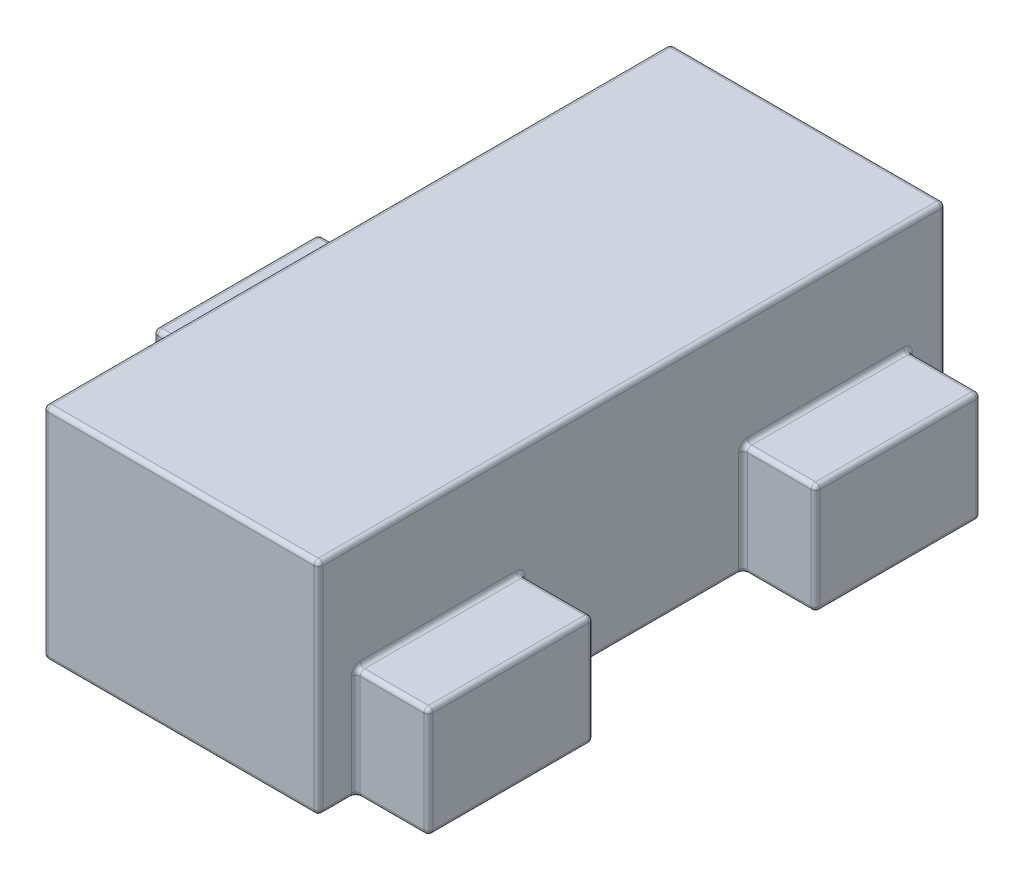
from build123d import *

# Parameters (mm, degrees)
SKETCH1_W           = 1.25
SKETCH1_H           = 2.85
BOSS_EXTRUDE1_DEPTH = 1
SKETCH2_W           = 0.55
SKETCH2_H           = 0.75
SKETCH2_W_2         = 0.33
BOSS_EXTRUDE2_DEPTH = 0.5
FILLET1_R           = 0.02


with BuildPart() as part:
    # Sketch1 → Boss-Extrude1 (new body)
    with BuildSketch(Plane(origin=(0, 0, 0), x_dir=(1, 0, 0), z_dir=(0, 1, 0))):
        Rectangle(SKETCH1_W, SKETCH1_H)
    extrude(amount=BOSS_EXTRUDE1_DEPTH)

    # Sketch2 → Boss-Extrude2 (add)
    with BuildSketch(Plane(origin=(0, 0, 0), x_dir=(1, 0, 0), z_dir=(0, 1, 0))):
        with Locations((-0.9, 0)):
            Rectangle(SKETCH2_W, SKETCH2_H)
        with Locations((0.79, 0.88)):
            Rectangle(SKETCH2_W_2, SKETCH2_H)
        with Locations((0.79, -0.88)):
            Rectangle(SKETCH2_W_2, SKETCH2_H)
    extrude(amount=BOSS_EXTRUDE2_DEPTH)

    # Fillet1
    fillet1_edges = [part.edges().sort_by_distance(p)[0] for p in [
        (-0.625, 1, 0),
        (0, 1, 1.425),
        (0.625, 0, -1.34),
        (0.625, 0.25, -1.255),
        (0.79, 0, -0.505),
        (0.625, 0.25, -0.505),
        (0.955, 0, -0.88),
        (0.955, 0.25, -0.505),
        (0.79, 0, -1.255),
        (0.955, 0.25, -1.255),
        (0.625, 0.5, -0.88),
        (0.79, 0.5, -0.505),
        (0.955, 0.5, -0.88),
        (0.79, 0.5, -1.255),
        (-0.625, 0, 0.9),
        (-0.9, 0, -0.375),
        (-0.625, 0.25, -0.375),
        (-1.175, 0, 0),
        (-1.175, 0.25, -0.375),
        (-0.9, 0, 0.375),
        (-1.175, 0.25, 0.375),
        (-0.625, 0.25, 0.375),
        (-0.9, 0.5, -0.375),
        (-1.175, 0.5, 0),
        (-0.9, 0.5, 0.375),
        (-0.625, 0.5, 0),
        (0.625, 0, 0),
        (0.625, 0.25, 0.505),
        (0.79, 0, 1.255),
        (0.625, 0.25, 1.255),
        (0.955, 0, 0.88),
        (0.955, 0.25, 1.255),
        (0.79, 0, 0.505),
        (0.955, 0.25, 0.505),
        (0.625, 0.5, 0.88),
        (0.79, 0.5, 1.255),
        (0.955, 0.5, 0.88),
        (0.625, 1, 0),
        (0.79, 0.5, 0.505),
        (0, 0, 1.425),
        (-0.625, 0, -0.9),
        (0, 0, -1.425),
        (0.625, 0, 1.34),
        (0, 1, -1.425),
        (0.625, 0.5, 1.425),
        (-0.625, 0.5, 1.425),
        (-0.625, 0.5, -1.425),
        (0.625, 0.5, -1.425),
    ]]
    fillet(fillet1_edges, radius=FILLET1_R)


solid = part.part
